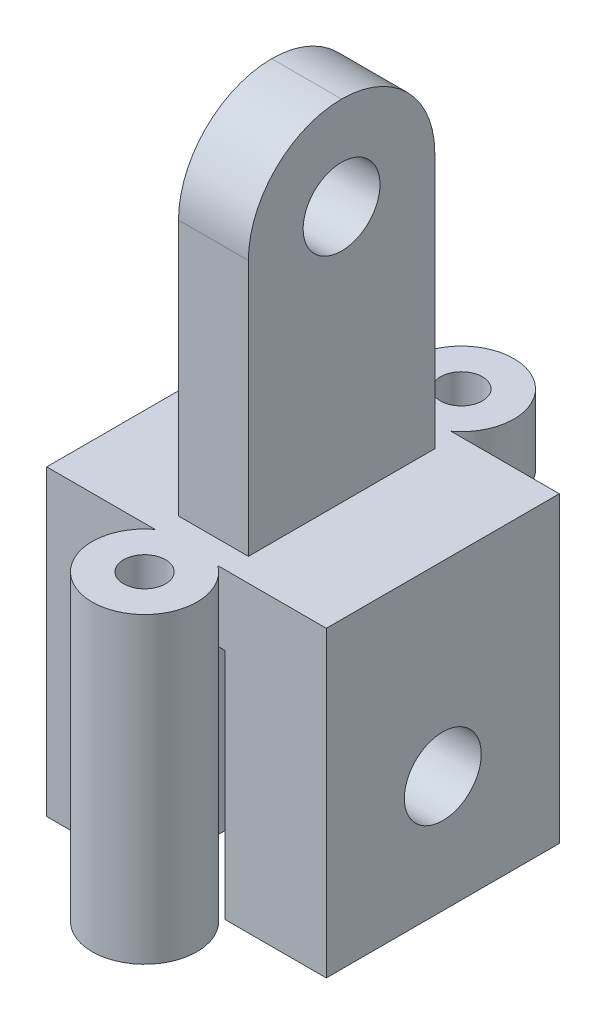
ISO-10303-21;
HEADER;
FILE_DESCRIPTION(('STEP AP214'),'2;1');
FILE_NAME('part.step','',(''),(''),'','','');
FILE_SCHEMA(('AUTOMOTIVE_DESIGN { 1 0 10303 214 1 1 1 1 }'));
ENDSEC;
DATA;
#1=APPLICATION_CONTEXT('core data for automotive mechanical design processes');
#2=APPLICATION_PROTOCOL_DEFINITION('international standard','automotive_design',2000,#1);
#3=PRODUCT_CONTEXT('',#1,'mechanical');
#4=PRODUCT('Part','Part','',(#3));
#5=PRODUCT_RELATED_PRODUCT_CATEGORY('part','',(#4));
#6=PRODUCT_DEFINITION_FORMATION('','',#4);
#7=PRODUCT_DEFINITION_CONTEXT('part definition',#1,'design');
#8=PRODUCT_DEFINITION('design','',#6,#7);
#9=PRODUCT_DEFINITION_SHAPE('','',#8);
#10=(LENGTH_UNIT() NAMED_UNIT(*) SI_UNIT(.MILLI.,.METRE.));
#11=(NAMED_UNIT(*) PLANE_ANGLE_UNIT() SI_UNIT($,.RADIAN.));
#12=(NAMED_UNIT(*) SI_UNIT($,.STERADIAN.) SOLID_ANGLE_UNIT());
#13=UNCERTAINTY_MEASURE_WITH_UNIT(LENGTH_MEASURE(1.E-05),#10,'distance_accuracy_value','');
#14=(GEOMETRIC_REPRESENTATION_CONTEXT(3) GLOBAL_UNCERTAINTY_ASSIGNED_CONTEXT((#13)) GLOBAL_UNIT_ASSIGNED_CONTEXT((#10,
#11,#12)) REPRESENTATION_CONTEXT('',''));
#15=CARTESIAN_POINT('',(0.,0.,0.));
#16=DIRECTION('',(0.,0.,1.));
#17=DIRECTION('',(1.,0.,0.));
#18=AXIS2_PLACEMENT_3D('',#15,#16,#17);
#19=CARTESIAN_POINT('',(0.,0.,10.));
#20=DIRECTION('',(0.,0.,-1.));
#21=DIRECTION('',(-1.,0.,0.));
#22=AXIS2_PLACEMENT_3D('',#19,#20,#21);
#23=PLANE('',#22);
#24=DIRECTION('',(1.,0.,0.));
#25=VECTOR('',#24,1.);
#26=CARTESIAN_POINT('',(4.35,10.,10.));
#27=LINE('',#26,#25);
#28=CARTESIAN_POINT('',(4.35,10.,10.));
#29=VERTEX_POINT('',#28);
#30=CARTESIAN_POINT('',(4.65,10.,10.));
#31=VERTEX_POINT('',#30);
#32=EDGE_CURVE('E274',#29,#31,#27,.T.);
#33=ORIENTED_EDGE('',*,*,#32,.T.);
#34=DIRECTION('',(0.,1.,0.));
#35=VECTOR('',#34,1.);
#36=CARTESIAN_POINT('',(4.65,0.,10.));
#37=LINE('',#36,#35);
#38=CARTESIAN_POINT('',(4.65,13.,10.));
#39=VERTEX_POINT('',#38);
#40=EDGE_CURVE('E11',#31,#39,#37,.T.);
#41=ORIENTED_EDGE('',*,*,#40,.T.);
#42=DIRECTION('',(-1.,0.,0.));
#43=VECTOR('',#42,1.);
#44=CARTESIAN_POINT('',(12.,13.,10.));
#45=LINE('',#44,#43);
#46=CARTESIAN_POINT('',(0.,13.,10.));
#47=VERTEX_POINT('',#46);
#48=EDGE_CURVE('E286',#39,#47,#45,.T.);
#49=ORIENTED_EDGE('',*,*,#48,.T.);
#50=DIRECTION('',(0.,-1.,0.));
#51=VECTOR('',#50,1.);
#52=CARTESIAN_POINT('',(0.,0.,10.));
#53=LINE('',#52,#51);
#54=CARTESIAN_POINT('',(0.,0.,10.));
#55=VERTEX_POINT('',#54);
#56=EDGE_CURVE('E262',#47,#55,#53,.T.);
#57=ORIENTED_EDGE('',*,*,#56,.T.);
#58=DIRECTION('',(1.,0.,0.));
#59=VECTOR('',#58,1.);
#60=CARTESIAN_POINT('',(0.,0.,10.));
#61=LINE('',#60,#59);
#62=CARTESIAN_POINT('',(4.35,0.,10.));
#63=VERTEX_POINT('',#62);
#64=EDGE_CURVE('E266',#55,#63,#61,.T.);
#65=ORIENTED_EDGE('',*,*,#64,.T.);
#66=DIRECTION('',(0.,1.,0.));
#67=VECTOR('',#66,1.);
#68=CARTESIAN_POINT('',(4.35,0.,10.));
#69=LINE('',#68,#67);
#70=EDGE_CURVE('E270',#63,#29,#69,.T.);
#71=ORIENTED_EDGE('',*,*,#70,.T.);
#72=EDGE_LOOP('',(#33,#41,#49,#57,#65,#71));
#73=FACE_BOUND('',#72,.T.);
#74=ADVANCED_FACE('F45',(#73),#23,.F.);
#75=CARTESIAN_POINT('',(0.,0.,0.));
#76=DIRECTION('',(0.,0.,-1.));
#77=DIRECTION('',(-1.,0.,0.));
#78=AXIS2_PLACEMENT_3D('',#75,#76,#77);
#79=PLANE('',#78);
#80=DIRECTION('',(0.,1.,0.));
#81=VECTOR('',#80,1.);
#82=CARTESIAN_POINT('',(4.65,10.,0.));
#83=LINE('',#82,#81);
#84=CARTESIAN_POINT('',(4.65,10.,0.));
#85=VERTEX_POINT('',#84);
#86=CARTESIAN_POINT('',(4.65,13.,0.));
#87=VERTEX_POINT('',#86);
#88=EDGE_CURVE('E206',#85,#87,#83,.T.);
#89=ORIENTED_EDGE('',*,*,#88,.F.);
#90=DIRECTION('',(1.,0.,0.));
#91=VECTOR('',#90,1.);
#92=CARTESIAN_POINT('',(4.35,10.,0.));
#93=LINE('',#92,#91);
#94=CARTESIAN_POINT('',(4.35,10.,0.));
#95=VERTEX_POINT('',#94);
#96=EDGE_CURVE('E301',#95,#85,#93,.T.);
#97=ORIENTED_EDGE('',*,*,#96,.F.);
#98=DIRECTION('',(0.,1.,0.));
#99=VECTOR('',#98,1.);
#100=CARTESIAN_POINT('',(4.35,0.,0.));
#101=LINE('',#100,#99);
#102=CARTESIAN_POINT('',(4.35,0.,0.));
#103=VERTEX_POINT('',#102);
#104=EDGE_CURVE('E297',#103,#95,#101,.T.);
#105=ORIENTED_EDGE('',*,*,#104,.F.);
#106=DIRECTION('',(1.,0.,0.));
#107=VECTOR('',#106,1.);
#108=CARTESIAN_POINT('',(0.,0.,0.));
#109=LINE('',#108,#107);
#110=CARTESIAN_POINT('',(0.,0.,0.));
#111=VERTEX_POINT('',#110);
#112=EDGE_CURVE('E294',#111,#103,#109,.T.);
#113=ORIENTED_EDGE('',*,*,#112,.F.);
#114=DIRECTION('',(0.,-1.,0.));
#115=VECTOR('',#114,1.);
#116=CARTESIAN_POINT('',(0.,0.,0.));
#117=LINE('',#116,#115);
#118=CARTESIAN_POINT('',(0.,13.,0.));
#119=VERTEX_POINT('',#118);
#120=EDGE_CURVE('E261',#119,#111,#117,.T.);
#121=ORIENTED_EDGE('',*,*,#120,.F.);
#122=DIRECTION('',(-1.,0.,0.));
#123=VECTOR('',#122,1.);
#124=CARTESIAN_POINT('',(0.,13.,0.));
#125=LINE('',#124,#123);
#126=EDGE_CURVE('E315',#87,#119,#125,.T.);
#127=ORIENTED_EDGE('',*,*,#126,.F.);
#128=EDGE_LOOP('',(#89,#97,#105,#113,#121,#127));
#129=FACE_BOUND('',#128,.T.);
#130=ADVANCED_FACE('F422',(#129),#79,.T.);
#131=CARTESIAN_POINT('',(7.65559250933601,28.,10.));
#132=DIRECTION('',(-1.,0.,0.));
#133=DIRECTION('',(0.,-1.,0.));
#134=AXIS2_PLACEMENT_3D('',#131,#132,#133);
#135=PLANE('',#134);
#136=CARTESIAN_POINT('',(7.65559250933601,24.,5.));
#137=DIRECTION('',(-1.,0.,0.));
#138=DIRECTION('',(0.,-1.,0.));
#139=AXIS2_PLACEMENT_3D('',#136,#137,#138);
#140=CIRCLE('',#139,1.65);
#141=CARTESIAN_POINT('',(7.65559250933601,22.35,5.));
#142=VERTEX_POINT('',#141);
#143=EDGE_CURVE('E237',#142,#142,#140,.T.);
#144=ORIENTED_EDGE('',*,*,#143,.T.);
#145=EDGE_LOOP('',(#144));
#146=FACE_BOUND('',#145,.T.);
#147=DIRECTION('',(0.,-1.,0.));
#148=VECTOR('',#147,1.);
#149=CARTESIAN_POINT('',(7.65559250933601,28.,1.));
#150=LINE('',#149,#148);
#151=CARTESIAN_POINT('',(7.65559250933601,24.,1.));
#152=VERTEX_POINT('',#151);
#153=CARTESIAN_POINT('',(7.65559250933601,13.,1.));
#154=VERTEX_POINT('',#153);
#155=EDGE_CURVE('E241',#152,#154,#150,.T.);
#156=ORIENTED_EDGE('',*,*,#155,.F.);
#157=CARTESIAN_POINT('',(7.65559250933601,24.,5.));
#158=DIRECTION('',(-1.,0.,0.));
#159=DIRECTION('',(0.,-1.,0.));
#160=AXIS2_PLACEMENT_3D('',#157,#158,#159);
#161=CIRCLE('',#160,4.);
#162=CARTESIAN_POINT('',(7.65559250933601,28.,5.));
#163=VERTEX_POINT('',#162);
#164=EDGE_CURVE('E365',#152,#163,#161,.F.);
#165=ORIENTED_EDGE('',*,*,#164,.T.);
#166=CARTESIAN_POINT('',(7.65559250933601,24.,5.));
#167=DIRECTION('',(-1.,0.,0.));
#168=DIRECTION('',(0.,-1.,0.));
#169=AXIS2_PLACEMENT_3D('',#166,#167,#168);
#170=CIRCLE('',#169,4.);
#171=CARTESIAN_POINT('',(7.65559250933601,24.,9.));
#172=VERTEX_POINT('',#171);
#173=EDGE_CURVE('E362',#163,#172,#170,.F.);
#174=ORIENTED_EDGE('',*,*,#173,.T.);
#175=DIRECTION('',(0.,1.,0.));
#176=VECTOR('',#175,1.);
#177=CARTESIAN_POINT('',(7.65559250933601,28.,9.));
#178=LINE('',#177,#176);
#179=CARTESIAN_POINT('',(7.65559250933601,13.,9.));
#180=VERTEX_POINT('',#179);
#181=EDGE_CURVE('E257',#180,#172,#178,.T.);
#182=ORIENTED_EDGE('',*,*,#181,.F.);
#183=DIRECTION('',(0.,0.,-1.));
#184=VECTOR('',#183,1.);
#185=CARTESIAN_POINT('',(7.65559250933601,13.,10.));
#186=LINE('',#185,#184);
#187=EDGE_CURVE('E326',#180,#154,#186,.T.);
#188=ORIENTED_EDGE('',*,*,#187,.T.);
#189=EDGE_LOOP('',(#156,#165,#174,#182,#188));
#190=FACE_BOUND('',#189,.T.);
#191=ADVANCED_FACE('F453',(#146,#190),#135,.F.);
#192=CARTESIAN_POINT('',(4.65559250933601,28.,10.));
#193=DIRECTION('',(1.,0.,0.));
#194=DIRECTION('',(0.,1.,0.));
#195=AXIS2_PLACEMENT_3D('',#192,#193,#194);
#196=PLANE('',#195);
#197=CARTESIAN_POINT('',(4.65559250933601,24.,5.));
#198=DIRECTION('',(-1.,0.,0.));
#199=DIRECTION('',(0.,-1.,0.));
#200=AXIS2_PLACEMENT_3D('',#197,#198,#199);
#201=CIRCLE('',#200,1.65);
#202=CARTESIAN_POINT('',(4.65559250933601,22.35,5.));
#203=VERTEX_POINT('',#202);
#204=EDGE_CURVE('E233',#203,#203,#201,.T.);
#205=ORIENTED_EDGE('',*,*,#204,.F.);
#206=EDGE_LOOP('',(#205));
#207=FACE_BOUND('',#206,.T.);
#208=CARTESIAN_POINT('',(4.65559250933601,24.,5.));
#209=DIRECTION('',(1.,0.,0.));
#210=DIRECTION('',(0.,1.,0.));
#211=AXIS2_PLACEMENT_3D('',#208,#209,#210);
#212=CIRCLE('',#211,4.);
#213=CARTESIAN_POINT('',(4.65559250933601,24.,9.));
#214=VERTEX_POINT('',#213);
#215=CARTESIAN_POINT('',(4.65559250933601,28.,5.));
#216=VERTEX_POINT('',#215);
#217=EDGE_CURVE('E368',#214,#216,#212,.F.);
#218=ORIENTED_EDGE('',*,*,#217,.T.);
#219=CARTESIAN_POINT('',(4.65559250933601,24.,5.));
#220=DIRECTION('',(1.,0.,0.));
#221=DIRECTION('',(0.,1.,0.));
#222=AXIS2_PLACEMENT_3D('',#219,#220,#221);
#223=CIRCLE('',#222,4.);
#224=CARTESIAN_POINT('',(4.65559250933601,24.,1.));
#225=VERTEX_POINT('',#224);
#226=EDGE_CURVE('E371',#216,#225,#223,.F.);
#227=ORIENTED_EDGE('',*,*,#226,.T.);
#228=DIRECTION('',(0.,1.,0.));
#229=VECTOR('',#228,1.);
#230=CARTESIAN_POINT('',(4.65559250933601,28.,1.));
#231=LINE('',#230,#229);
#232=CARTESIAN_POINT('',(4.65559250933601,13.,1.));
#233=VERTEX_POINT('',#232);
#234=EDGE_CURVE('E247',#233,#225,#231,.T.);
#235=ORIENTED_EDGE('',*,*,#234,.F.);
#236=DIRECTION('',(0.,0.,-1.));
#237=VECTOR('',#236,1.);
#238=CARTESIAN_POINT('',(4.65559250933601,13.,10.));
#239=LINE('',#238,#237);
#240=CARTESIAN_POINT('',(4.65559250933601,13.,9.));
#241=VERTEX_POINT('',#240);
#242=EDGE_CURVE('E322',#241,#233,#239,.T.);
#243=ORIENTED_EDGE('',*,*,#242,.F.);
#244=DIRECTION('',(0.,-1.,0.));
#245=VECTOR('',#244,1.);
#246=CARTESIAN_POINT('',(4.65559250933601,28.,9.));
#247=LINE('',#246,#245);
#248=EDGE_CURVE('E251',#214,#241,#247,.T.);
#249=ORIENTED_EDGE('',*,*,#248,.F.);
#250=EDGE_LOOP('',(#218,#227,#235,#243,#249));
#251=FACE_BOUND('',#250,.T.);
#252=ADVANCED_FACE('F473',(#207,#251),#196,.F.);
#253=CARTESIAN_POINT('',(0.,0.,10.));
#254=DIRECTION('',(1.,0.,0.));
#255=DIRECTION('',(0.,1.,0.));
#256=AXIS2_PLACEMENT_3D('',#253,#254,#255);
#257=PLANE('',#256);
#258=CARTESIAN_POINT('',(0.,5.,5.));
#259=DIRECTION('',(-1.,0.,0.));
#260=DIRECTION('',(0.,-1.,0.));
#261=AXIS2_PLACEMENT_3D('',#258,#259,#260);
#262=CIRCLE('',#261,1.65);
#263=CARTESIAN_POINT('',(0.,3.35,5.));
#264=VERTEX_POINT('',#263);
#265=EDGE_CURVE('E213',#264,#264,#262,.T.);
#266=ORIENTED_EDGE('',*,*,#265,.F.);
#267=EDGE_LOOP('',(#266));
#268=FACE_BOUND('',#267,.T.);
#269=ORIENTED_EDGE('',*,*,#120,.T.);
#270=DIRECTION('',(0.,0.,-1.));
#271=VECTOR('',#270,1.);
#272=CARTESIAN_POINT('',(0.,0.,10.));
#273=LINE('',#272,#271);
#274=EDGE_CURVE('E354',#55,#111,#273,.T.);
#275=ORIENTED_EDGE('',*,*,#274,.F.);
#276=ORIENTED_EDGE('',*,*,#56,.F.);
#277=DIRECTION('',(0.,0.,-1.));
#278=VECTOR('',#277,1.);
#279=CARTESIAN_POINT('',(0.,13.,10.));
#280=LINE('',#279,#278);
#281=EDGE_CURVE('E290',#47,#119,#280,.T.);
#282=ORIENTED_EDGE('',*,*,#281,.T.);
#283=EDGE_LOOP('',(#269,#275,#276,#282));
#284=FACE_BOUND('',#283,.T.);
#285=ADVANCED_FACE('F428',(#268,#284),#257,.F.);
#286=CARTESIAN_POINT('',(0.,0.,10.));
#287=DIRECTION('',(0.,1.,0.));
#288=DIRECTION('',(0.,0.,1.));
#289=AXIS2_PLACEMENT_3D('',#286,#287,#288);
#290=PLANE('',#289);
#291=ORIENTED_EDGE('',*,*,#112,.T.);
#292=DIRECTION('',(0.,0.,-1.));
#293=VECTOR('',#292,1.);
#294=CARTESIAN_POINT('',(4.35,0.,10.));
#295=LINE('',#294,#293);
#296=EDGE_CURVE('E350',#63,#103,#295,.T.);
#297=ORIENTED_EDGE('',*,*,#296,.F.);
#298=ORIENTED_EDGE('',*,*,#64,.F.);
#299=ORIENTED_EDGE('',*,*,#274,.T.);
#300=EDGE_LOOP('',(#291,#297,#298,#299));
#301=FACE_BOUND('',#300,.T.);
#302=ADVANCED_FACE('F432',(#301),#290,.F.);
#303=CARTESIAN_POINT('',(4.35,0.,10.));
#304=DIRECTION('',(-1.,0.,0.));
#305=DIRECTION('',(0.,0.,1.));
#306=AXIS2_PLACEMENT_3D('',#303,#304,#305);
#307=PLANE('',#306);
#308=CARTESIAN_POINT('',(4.35,5.,5.));
#309=DIRECTION('',(-1.,0.,0.));
#310=DIRECTION('',(0.,0.,1.));
#311=AXIS2_PLACEMENT_3D('',#308,#309,#310);
#312=CIRCLE('',#311,1.65);
#313=CARTESIAN_POINT('',(4.35,3.35,5.));
#314=VERTEX_POINT('',#313);
#315=EDGE_CURVE('E228',#314,#314,#312,.T.);
#316=ORIENTED_EDGE('',*,*,#315,.T.);
#317=EDGE_LOOP('',(#316));
#318=FACE_BOUND('',#317,.T.);
#319=ORIENTED_EDGE('',*,*,#104,.T.);
#320=DIRECTION('',(0.,0.,-1.));
#321=VECTOR('',#320,1.);
#322=CARTESIAN_POINT('',(4.35,10.,10.));
#323=LINE('',#322,#321);
#324=EDGE_CURVE('E346',#29,#95,#323,.T.);
#325=ORIENTED_EDGE('',*,*,#324,.F.);
#326=ORIENTED_EDGE('',*,*,#70,.F.);
#327=ORIENTED_EDGE('',*,*,#296,.T.);
#328=EDGE_LOOP('',(#319,#325,#326,#327));
#329=FACE_BOUND('',#328,.T.);
#330=ADVANCED_FACE('F433',(#318,#329),#307,.F.);
#331=CARTESIAN_POINT('',(4.35,10.,10.));
#332=DIRECTION('',(0.,1.,0.));
#333=DIRECTION('',(0.,0.,1.));
#334=AXIS2_PLACEMENT_3D('',#331,#332,#333);
#335=PLANE('',#334);
#336=CARTESIAN_POINT('',(6.,10.,-1.8));
#337=DIRECTION('',(0.,1.,0.));
#338=DIRECTION('',(0.,0.,1.));
#339=AXIS2_PLACEMENT_3D('',#336,#337,#338);
#340=CIRCLE('',#339,0.9);
#341=CARTESIAN_POINT('',(6.,10.,-0.9));
#342=VERTEX_POINT('',#341);
#343=EDGE_CURVE('E199',#342,#342,#340,.T.);
#344=ORIENTED_EDGE('',*,*,#343,.T.);
#345=EDGE_LOOP('',(#344));
#346=FACE_BOUND('',#345,.T.);
#347=ORIENTED_EDGE('',*,*,#96,.T.);
#348=CARTESIAN_POINT('',(6.,10.,-1.8));
#349=DIRECTION('',(0.,1.,0.));
#350=DIRECTION('',(0.,0.,1.));
#351=AXIS2_PLACEMENT_3D('',#348,#349,#350);
#352=CIRCLE('',#351,2.25);
#353=CARTESIAN_POINT('',(7.35,10.,0.));
#354=VERTEX_POINT('',#353);
#355=EDGE_CURVE('E203',#354,#85,#352,.T.);
#356=ORIENTED_EDGE('',*,*,#355,.F.);
#357=CARTESIAN_POINT('',(7.65,10.,0.));
#358=VERTEX_POINT('',#357);
#359=EDGE_CURVE('E300',#354,#358,#93,.T.);
#360=ORIENTED_EDGE('',*,*,#359,.T.);
#361=DIRECTION('',(0.,0.,-1.));
#362=VECTOR('',#361,1.);
#363=CARTESIAN_POINT('',(7.65,10.,10.));
#364=LINE('',#363,#362);
#365=CARTESIAN_POINT('',(7.65,10.,10.));
#366=VERTEX_POINT('',#365);
#367=EDGE_CURVE('E342',#366,#358,#364,.T.);
#368=ORIENTED_EDGE('',*,*,#367,.F.);
#369=CARTESIAN_POINT('',(7.35,10.,10.));
#370=VERTEX_POINT('',#369);
#371=EDGE_CURVE('E273',#370,#366,#27,.T.);
#372=ORIENTED_EDGE('',*,*,#371,.F.);
#373=EDGE_CURVE('E68',#31,#370,#27,.T.);
#374=ORIENTED_EDGE('',*,*,#373,.F.);
#375=ORIENTED_EDGE('',*,*,#32,.F.);
#376=ORIENTED_EDGE('',*,*,#324,.T.);
#377=EDGE_LOOP('',(#347,#356,#360,#368,#372,#374,#375,#376));
#378=FACE_BOUND('',#377,.T.);
#379=ADVANCED_FACE('F389',(#346,#378),#335,.F.);
#380=CARTESIAN_POINT('',(7.65,0.,10.));
#381=DIRECTION('',(1.,0.,0.));
#382=DIRECTION('',(0.,0.,-1.));
#383=AXIS2_PLACEMENT_3D('',#380,#381,#382);
#384=PLANE('',#383);
#385=CARTESIAN_POINT('',(7.65,5.,5.));
#386=DIRECTION('',(1.,0.,0.));
#387=DIRECTION('',(0.,0.,-1.));
#388=AXIS2_PLACEMENT_3D('',#385,#386,#387);
#389=CIRCLE('',#388,1.65);
#390=CARTESIAN_POINT('',(7.65,3.35,5.));
#391=VERTEX_POINT('',#390);
#392=EDGE_CURVE('E221',#391,#391,#389,.T.);
#393=ORIENTED_EDGE('',*,*,#392,.T.);
#394=EDGE_LOOP('',(#393));
#395=FACE_BOUND('',#394,.T.);
#396=DIRECTION('',(0.,-1.,0.));
#397=VECTOR('',#396,1.);
#398=CARTESIAN_POINT('',(7.65,0.,0.));
#399=LINE('',#398,#397);
#400=CARTESIAN_POINT('',(7.65,0.,0.));
#401=VERTEX_POINT('',#400);
#402=EDGE_CURVE('E305',#358,#401,#399,.T.);
#403=ORIENTED_EDGE('',*,*,#402,.T.);
#404=DIRECTION('',(0.,0.,-1.));
#405=VECTOR('',#404,1.);
#406=CARTESIAN_POINT('',(7.65,0.,10.));
#407=LINE('',#406,#405);
#408=CARTESIAN_POINT('',(7.65,0.,10.));
#409=VERTEX_POINT('',#408);
#410=EDGE_CURVE('E338',#409,#401,#407,.T.);
#411=ORIENTED_EDGE('',*,*,#410,.F.);
#412=DIRECTION('',(0.,-1.,0.));
#413=VECTOR('',#412,1.);
#414=CARTESIAN_POINT('',(7.65,0.,10.));
#415=LINE('',#414,#413);
#416=EDGE_CURVE('E277',#366,#409,#415,.T.);
#417=ORIENTED_EDGE('',*,*,#416,.F.);
#418=ORIENTED_EDGE('',*,*,#367,.T.);
#419=EDGE_LOOP('',(#403,#411,#417,#418));
#420=FACE_BOUND('',#419,.T.);
#421=ADVANCED_FACE('F394',(#395,#420),#384,.F.);
#422=CARTESIAN_POINT('',(7.65,0.,10.));
#423=DIRECTION('',(0.,1.,0.));
#424=DIRECTION('',(0.,0.,1.));
#425=AXIS2_PLACEMENT_3D('',#422,#423,#424);
#426=PLANE('',#425);
#427=DIRECTION('',(1.,0.,0.));
#428=VECTOR('',#427,1.);
#429=CARTESIAN_POINT('',(7.65,0.,0.));
#430=LINE('',#429,#428);
#431=CARTESIAN_POINT('',(12.,0.,0.));
#432=VERTEX_POINT('',#431);
#433=EDGE_CURVE('E308',#401,#432,#430,.T.);
#434=ORIENTED_EDGE('',*,*,#433,.T.);
#435=DIRECTION('',(0.,0.,-1.));
#436=VECTOR('',#435,1.);
#437=CARTESIAN_POINT('',(12.,0.,10.));
#438=LINE('',#437,#436);
#439=CARTESIAN_POINT('',(12.,0.,10.));
#440=VERTEX_POINT('',#439);
#441=EDGE_CURVE('E334',#440,#432,#438,.T.);
#442=ORIENTED_EDGE('',*,*,#441,.F.);
#443=DIRECTION('',(1.,0.,0.));
#444=VECTOR('',#443,1.);
#445=CARTESIAN_POINT('',(7.65,0.,10.));
#446=LINE('',#445,#444);
#447=EDGE_CURVE('E280',#409,#440,#446,.T.);
#448=ORIENTED_EDGE('',*,*,#447,.F.);
#449=ORIENTED_EDGE('',*,*,#410,.T.);
#450=EDGE_LOOP('',(#434,#442,#448,#449));
#451=FACE_BOUND('',#450,.T.);
#452=ADVANCED_FACE('F401',(#451),#426,.F.);
#453=CARTESIAN_POINT('',(12.,0.,10.));
#454=DIRECTION('',(-1.,0.,0.));
#455=DIRECTION('',(0.,-1.,0.));
#456=AXIS2_PLACEMENT_3D('',#453,#454,#455);
#457=PLANE('',#456);
#458=CARTESIAN_POINT('',(12.,5.,5.));
#459=DIRECTION('',(-1.,0.,0.));
#460=DIRECTION('',(0.,-1.,0.));
#461=AXIS2_PLACEMENT_3D('',#458,#459,#460);
#462=CIRCLE('',#461,1.65);
#463=CARTESIAN_POINT('',(12.,3.35,5.));
#464=VERTEX_POINT('',#463);
#465=EDGE_CURVE('E217',#464,#464,#462,.T.);
#466=ORIENTED_EDGE('',*,*,#465,.T.);
#467=EDGE_LOOP('',(#466));
#468=FACE_BOUND('',#467,.T.);
#469=DIRECTION('',(0.,1.,0.));
#470=VECTOR('',#469,1.);
#471=CARTESIAN_POINT('',(12.,0.,0.));
#472=LINE('',#471,#470);
#473=CARTESIAN_POINT('',(12.,13.,0.));
#474=VERTEX_POINT('',#473);
#475=EDGE_CURVE('E311',#432,#474,#472,.T.);
#476=ORIENTED_EDGE('',*,*,#475,.T.);
#477=DIRECTION('',(0.,0.,-1.));
#478=VECTOR('',#477,1.);
#479=CARTESIAN_POINT('',(12.,13.,10.));
#480=LINE('',#479,#478);
#481=CARTESIAN_POINT('',(12.,13.,10.));
#482=VERTEX_POINT('',#481);
#483=EDGE_CURVE('E330',#482,#474,#480,.T.);
#484=ORIENTED_EDGE('',*,*,#483,.F.);
#485=DIRECTION('',(0.,1.,0.));
#486=VECTOR('',#485,1.);
#487=CARTESIAN_POINT('',(12.,0.,10.));
#488=LINE('',#487,#486);
#489=EDGE_CURVE('E283',#440,#482,#488,.T.);
#490=ORIENTED_EDGE('',*,*,#489,.F.);
#491=ORIENTED_EDGE('',*,*,#441,.T.);
#492=EDGE_LOOP('',(#476,#484,#490,#491));
#493=FACE_BOUND('',#492,.T.);
#494=ADVANCED_FACE('F405',(#468,#493),#457,.F.);
#495=CARTESIAN_POINT('',(0.,13.,10.));
#496=DIRECTION('',(0.,-1.,0.));
#497=DIRECTION('',(0.,0.,-1.));
#498=AXIS2_PLACEMENT_3D('',#495,#496,#497);
#499=PLANE('',#498);
#500=CARTESIAN_POINT('',(6.,13.,11.8));
#501=DIRECTION('',(0.,-1.,0.));
#502=DIRECTION('',(0.,0.,-1.));
#503=AXIS2_PLACEMENT_3D('',#500,#501,#502);
#504=CIRCLE('',#503,0.899999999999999);
#505=CARTESIAN_POINT('',(6.,13.,12.7));
#506=VERTEX_POINT('',#505);
#507=EDGE_CURVE('E675',#506,#506,#504,.T.);
#508=ORIENTED_EDGE('',*,*,#507,.T.);
#509=EDGE_LOOP('',(#508));
#510=FACE_BOUND('',#509,.T.);
#511=CARTESIAN_POINT('',(6.,13.,-1.8));
#512=DIRECTION('',(0.,-1.,0.));
#513=DIRECTION('',(0.,0.,-1.));
#514=AXIS2_PLACEMENT_3D('',#511,#512,#513);
#515=CIRCLE('',#514,0.9);
#516=CARTESIAN_POINT('',(6.,13.,-0.9));
#517=VERTEX_POINT('',#516);
#518=EDGE_CURVE('E49',#517,#517,#515,.T.);
#519=ORIENTED_EDGE('',*,*,#518,.T.);
#520=EDGE_LOOP('',(#519));
#521=FACE_BOUND('',#520,.T.);
#522=ORIENTED_EDGE('',*,*,#483,.T.);
#523=CARTESIAN_POINT('',(7.35,13.,0.));
#524=VERTEX_POINT('',#523);
#525=EDGE_CURVE('E267',#474,#524,#125,.T.);
#526=ORIENTED_EDGE('',*,*,#525,.T.);
#527=CARTESIAN_POINT('',(6.,13.,-1.8));
#528=DIRECTION('',(0.,1.,0.));
#529=DIRECTION('',(0.,0.,1.));
#530=AXIS2_PLACEMENT_3D('',#527,#528,#529);
#531=CIRCLE('',#530,2.25);
#532=EDGE_CURVE('E201',#524,#87,#531,.T.);
#533=ORIENTED_EDGE('',*,*,#532,.T.);
#534=ORIENTED_EDGE('',*,*,#126,.T.);
#535=ORIENTED_EDGE('',*,*,#281,.F.);
#536=ORIENTED_EDGE('',*,*,#48,.F.);
#537=CARTESIAN_POINT('',(6.,13.,11.8));
#538=DIRECTION('',(0.,1.,0.));
#539=DIRECTION('',(0.,0.,1.));
#540=AXIS2_PLACEMENT_3D('',#537,#538,#539);
#541=CIRCLE('',#540,2.25);
#542=CARTESIAN_POINT('',(7.35,13.,10.));
#543=VERTEX_POINT('',#542);
#544=EDGE_CURVE('E189',#39,#543,#541,.T.);
#545=ORIENTED_EDGE('',*,*,#544,.T.);
#546=EDGE_CURVE('E287',#482,#543,#45,.T.);
#547=ORIENTED_EDGE('',*,*,#546,.F.);
#548=EDGE_LOOP('',(#522,#526,#533,#534,#535,#536,#545,#547));
#549=FACE_BOUND('',#548,.T.);
#550=DIRECTION('',(-1.,0.,0.));
#551=VECTOR('',#550,1.);
#552=CARTESIAN_POINT('',(7.65559250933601,13.,1.));
#553=LINE('',#552,#551);
#554=EDGE_CURVE('E244',#154,#233,#553,.T.);
#555=ORIENTED_EDGE('',*,*,#554,.F.);
#556=ORIENTED_EDGE('',*,*,#187,.F.);
#557=DIRECTION('',(1.,0.,0.));
#558=VECTOR('',#557,1.);
#559=CARTESIAN_POINT('',(4.65559250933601,13.,9.));
#560=LINE('',#559,#558);
#561=EDGE_CURVE('E254',#241,#180,#560,.T.);
#562=ORIENTED_EDGE('',*,*,#561,.F.);
#563=ORIENTED_EDGE('',*,*,#242,.T.);
#564=EDGE_LOOP('',(#555,#556,#562,#563));
#565=FACE_BOUND('',#564,.T.);
#566=ADVANCED_FACE('F410',(#510,#521,#549,#565),#499,.F.);
#567=ORIENTED_EDGE('',*,*,#546,.T.);
#568=DIRECTION('',(0.,1.,0.));
#569=VECTOR('',#568,1.);
#570=CARTESIAN_POINT('',(7.35,0.,10.));
#571=LINE('',#570,#569);
#572=EDGE_CURVE('E55',#543,#370,#571,.F.);
#573=ORIENTED_EDGE('',*,*,#572,.T.);
#574=ORIENTED_EDGE('',*,*,#371,.T.);
#575=ORIENTED_EDGE('',*,*,#416,.T.);
#576=ORIENTED_EDGE('',*,*,#447,.T.);
#577=ORIENTED_EDGE('',*,*,#489,.T.);
#578=EDGE_LOOP('',(#567,#573,#574,#575,#576,#577));
#579=FACE_BOUND('',#578,.T.);
#580=ADVANCED_FACE('F408',(#579),#23,.F.);
#581=DIRECTION('',(0.,1.,0.));
#582=VECTOR('',#581,1.);
#583=CARTESIAN_POINT('',(7.35,10.,0.));
#584=LINE('',#583,#582);
#585=EDGE_CURVE('E209',#354,#524,#584,.T.);
#586=ORIENTED_EDGE('',*,*,#585,.T.);
#587=ORIENTED_EDGE('',*,*,#525,.F.);
#588=ORIENTED_EDGE('',*,*,#475,.F.);
#589=ORIENTED_EDGE('',*,*,#433,.F.);
#590=ORIENTED_EDGE('',*,*,#402,.F.);
#591=ORIENTED_EDGE('',*,*,#359,.F.);
#592=EDGE_LOOP('',(#586,#587,#588,#589,#590,#591));
#593=FACE_BOUND('',#592,.T.);
#594=ADVANCED_FACE('F397',(#593),#79,.T.);
#595=CARTESIAN_POINT('',(0.,0.,9.));
#596=DIRECTION('',(0.,0.,1.));
#597=DIRECTION('',(1.,0.,0.));
#598=AXIS2_PLACEMENT_3D('',#595,#596,#597);
#599=PLANE('',#598);
#600=ORIENTED_EDGE('',*,*,#181,.T.);
#601=DIRECTION('',(-1.,0.,0.));
#602=VECTOR('',#601,1.);
#603=CARTESIAN_POINT('',(4.65559250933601,24.,9.));
#604=LINE('',#603,#602);
#605=EDGE_CURVE('E374',#172,#214,#604,.T.);
#606=ORIENTED_EDGE('',*,*,#605,.T.);
#607=ORIENTED_EDGE('',*,*,#248,.T.);
#608=ORIENTED_EDGE('',*,*,#561,.T.);
#609=EDGE_LOOP('',(#600,#606,#607,#608));
#610=FACE_BOUND('',#609,.T.);
#611=ADVANCED_FACE('F460',(#610),#599,.T.);
#612=CARTESIAN_POINT('',(0.,0.,1.));
#613=DIRECTION('',(0.,0.,-1.));
#614=DIRECTION('',(-1.,0.,0.));
#615=AXIS2_PLACEMENT_3D('',#612,#613,#614);
#616=PLANE('',#615);
#617=ORIENTED_EDGE('',*,*,#234,.T.);
#618=DIRECTION('',(1.,0.,0.));
#619=VECTOR('',#618,1.);
#620=CARTESIAN_POINT('',(7.65559250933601,24.,1.));
#621=LINE('',#620,#619);
#622=EDGE_CURVE('E358',#225,#152,#621,.T.);
#623=ORIENTED_EDGE('',*,*,#622,.T.);
#624=ORIENTED_EDGE('',*,*,#155,.T.);
#625=ORIENTED_EDGE('',*,*,#554,.T.);
#626=EDGE_LOOP('',(#617,#623,#624,#625));
#627=FACE_BOUND('',#626,.T.);
#628=ADVANCED_FACE('F506',(#627),#616,.T.);
#629=CARTESIAN_POINT('',(12.,24.,5.));
#630=DIRECTION('',(-1.,0.,0.));
#631=DIRECTION('',(0.,-1.,0.));
#632=AXIS2_PLACEMENT_3D('',#629,#630,#631);
#633=CYLINDRICAL_SURFACE('',#632,1.65);
#634=ORIENTED_EDGE('',*,*,#204,.T.);
#635=EDGE_LOOP('',(#634));
#636=FACE_BOUND('',#635,.T.);
#637=ORIENTED_EDGE('',*,*,#143,.F.);
#638=EDGE_LOOP('',(#637));
#639=FACE_BOUND('',#638,.T.);
#640=ADVANCED_FACE('F503',(#636,#639),#633,.F.);
#641=CARTESIAN_POINT('',(0.,24.,5.));
#642=DIRECTION('',(1.,0.,0.));
#643=DIRECTION('',(0.,0.,-1.));
#644=AXIS2_PLACEMENT_3D('',#641,#642,#643);
#645=CYLINDRICAL_SURFACE('',#644,4.);
#646=DIRECTION('',(-1.,0.,0.));
#647=VECTOR('',#646,1.);
#648=CARTESIAN_POINT('',(7.65559250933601,28.,5.));
#649=LINE('',#648,#647);
#650=EDGE_CURVE('E232',#216,#163,#649,.F.);
#651=ORIENTED_EDGE('',*,*,#650,.F.);
#652=ORIENTED_EDGE('',*,*,#217,.F.);
#653=ORIENTED_EDGE('',*,*,#605,.F.);
#654=ORIENTED_EDGE('',*,*,#173,.F.);
#655=EDGE_LOOP('',(#651,#652,#653,#654));
#656=FACE_BOUND('',#655,.T.);
#657=ADVANCED_FACE('F47',(#656),#645,.T.);
#658=CARTESIAN_POINT('',(0.,24.,5.));
#659=DIRECTION('',(-1.,0.,0.));
#660=DIRECTION('',(0.,0.,1.));
#661=AXIS2_PLACEMENT_3D('',#658,#659,#660);
#662=CYLINDRICAL_SURFACE('',#661,4.);
#663=ORIENTED_EDGE('',*,*,#226,.F.);
#664=ORIENTED_EDGE('',*,*,#650,.T.);
#665=ORIENTED_EDGE('',*,*,#164,.F.);
#666=ORIENTED_EDGE('',*,*,#622,.F.);
#667=EDGE_LOOP('',(#663,#664,#665,#666));
#668=FACE_BOUND('',#667,.T.);
#669=ADVANCED_FACE('F490',(#668),#662,.T.);
#670=CARTESIAN_POINT('',(12.,5.,5.));
#671=DIRECTION('',(-1.,0.,0.));
#672=DIRECTION('',(0.,-1.,0.));
#673=AXIS2_PLACEMENT_3D('',#670,#671,#672);
#674=CYLINDRICAL_SURFACE('',#673,1.65);
#675=CARTESIAN_POINT('',(12.,3.35,5.));
#676=CARTESIAN_POINT('',(11.9546875,3.35,5.));
#677=CARTESIAN_POINT('',(11.909375,3.35,5.));
#678=CARTESIAN_POINT('',(11.81875,3.35,5.));
#679=CARTESIAN_POINT('',(11.7734375,3.35,5.));
#680=CARTESIAN_POINT('',(11.6828125,3.35,5.));
#681=CARTESIAN_POINT('',(11.6375,3.35,5.));
#682=CARTESIAN_POINT('',(11.546875,3.35,5.));
#683=CARTESIAN_POINT('',(11.5015625,3.35,5.));
#684=CARTESIAN_POINT('',(11.4109375,3.35,5.));
#685=CARTESIAN_POINT('',(11.365625,3.35,5.));
#686=CARTESIAN_POINT('',(11.275,3.35,5.));
#687=CARTESIAN_POINT('',(11.2296875,3.35,5.));
#688=CARTESIAN_POINT('',(11.1390625,3.35,5.));
#689=CARTESIAN_POINT('',(11.09375,3.35,5.));
#690=CARTESIAN_POINT('',(11.003125,3.35,5.));
#691=CARTESIAN_POINT('',(10.9578125,3.35,5.));
#692=CARTESIAN_POINT('',(10.8671875,3.35,5.));
#693=CARTESIAN_POINT('',(10.821875,3.35,5.));
#694=CARTESIAN_POINT('',(10.73125,3.35,5.));
#695=CARTESIAN_POINT('',(10.6859375,3.35,5.));
#696=CARTESIAN_POINT('',(10.5953125,3.35,5.));
#697=CARTESIAN_POINT('',(10.55,3.35,5.));
#698=CARTESIAN_POINT('',(10.459375,3.35,5.));
#699=CARTESIAN_POINT('',(10.4140625,3.35,5.));
#700=CARTESIAN_POINT('',(10.3234375,3.35,5.));
#701=CARTESIAN_POINT('',(10.278125,3.35,5.));
#702=CARTESIAN_POINT('',(10.1875,3.35,5.));
#703=CARTESIAN_POINT('',(10.1421875,3.35,5.));
#704=CARTESIAN_POINT('',(10.0515625,3.35,5.));
#705=CARTESIAN_POINT('',(10.00625,3.35,5.));
#706=CARTESIAN_POINT('',(9.915625,3.35,5.));
#707=CARTESIAN_POINT('',(9.8703125,3.35,5.));
#708=CARTESIAN_POINT('',(9.7796875,3.35,5.));
#709=CARTESIAN_POINT('',(9.734375,3.35,5.));
#710=CARTESIAN_POINT('',(9.64375,3.35,5.));
#711=CARTESIAN_POINT('',(9.5984375,3.35,5.));
#712=CARTESIAN_POINT('',(9.5078125,3.35,5.));
#713=CARTESIAN_POINT('',(9.4625,3.35,5.));
#714=CARTESIAN_POINT('',(9.371875,3.35,5.));
#715=CARTESIAN_POINT('',(9.3265625,3.35,5.));
#716=CARTESIAN_POINT('',(9.2359375,3.35,5.));
#717=CARTESIAN_POINT('',(9.190625,3.35,5.));
#718=CARTESIAN_POINT('',(9.1,3.35,5.));
#719=CARTESIAN_POINT('',(9.0546875,3.35,5.));
#720=CARTESIAN_POINT('',(8.9640625,3.35,5.));
#721=CARTESIAN_POINT('',(8.91875,3.35,5.));
#722=CARTESIAN_POINT('',(8.828125,3.35,5.));
#723=CARTESIAN_POINT('',(8.7828125,3.35,5.));
#724=CARTESIAN_POINT('',(8.6921875,3.35,5.));
#725=CARTESIAN_POINT('',(8.646875,3.35,5.));
#726=CARTESIAN_POINT('',(8.55625,3.35,5.));
#727=CARTESIAN_POINT('',(8.5109375,3.35,5.));
#728=CARTESIAN_POINT('',(8.4203125,3.35,5.));
#729=CARTESIAN_POINT('',(8.375,3.35,5.));
#730=CARTESIAN_POINT('',(8.284375,3.35,5.));
#731=CARTESIAN_POINT('',(8.2390625,3.35,5.));
#732=CARTESIAN_POINT('',(8.1484375,3.35,5.));
#733=CARTESIAN_POINT('',(8.103125,3.35,5.));
#734=CARTESIAN_POINT('',(8.0125,3.35,5.));
#735=CARTESIAN_POINT('',(7.9671875,3.35,5.));
#736=CARTESIAN_POINT('',(7.8765625,3.35,5.));
#737=CARTESIAN_POINT('',(7.83125,3.35,5.));
#738=CARTESIAN_POINT('',(7.740625,3.35,5.));
#739=CARTESIAN_POINT('',(7.6953125,3.35,5.));
#740=CARTESIAN_POINT('',(7.65,3.35,5.));
#741=B_SPLINE_CURVE_WITH_KNOTS('',3,(#675,#676,#677,#678,#679,#680,#681,#682,#683,#684,#685,
#686,#687,#688,#689,#690,#691,#692,#693,#694,#695,#696,#697,#698,#699,#700,#701,#702,#703,#704,
#705,#706,#707,#708,#709,#710,#711,#712,#713,#714,#715,#716,#717,#718,#719,#720,#721,#722,#723,
#724,#725,#726,#727,#728,#729,#730,#731,#732,#733,#734,#735,#736,#737,#738,#739,#740),
.UNSPECIFIED.,.F.,.F.,(4,2,2,2,2,2,2,2,2,2,2,2,2,2,2,2,2,2,2,2,2,2,2,2,2,2,2,2,2,2,2,2,4),(0.,
0.135937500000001,0.271875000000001,0.4078125,0.543750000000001,0.679687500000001,0.815625,
0.951562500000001,1.0875,1.2234375,1.359375,1.4953125,1.63125,1.7671875,1.903125,2.0390625,
2.175,2.3109375,2.446875,2.5828125,2.71875,2.8546875,2.990625,3.1265625,3.2625,3.3984375,
3.534375,3.6703125,3.80625,3.9421875,4.078125,4.2140625,4.35),.UNSPECIFIED.);
#742=EDGE_CURVE('BSEAM487',#464,#391,#741,.T.);
#743=ORIENTED_EDGE('',*,*,#465,.F.);
#744=ORIENTED_EDGE('',*,*,#392,.F.);
#745=ORIENTED_EDGE('',*,*,#742,.T.);
#746=ORIENTED_EDGE('',*,*,#742,.F.);
#747=EDGE_LOOP('',(#743,#745,#744,#746));
#748=FACE_BOUND('',#747,.T.);
#749=ADVANCED_FACE('F487',(#748),#674,.F.);
#750=CARTESIAN_POINT('',(0.,3.35,5.));
#751=CARTESIAN_POINT('',(0.0453125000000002,3.35,5.));
#752=CARTESIAN_POINT('',(0.0906250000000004,3.35,5.));
#753=CARTESIAN_POINT('',(0.18125,3.35,5.));
#754=CARTESIAN_POINT('',(0.2265625,3.35,5.));
#755=CARTESIAN_POINT('',(0.3171875,3.35,5.));
#756=CARTESIAN_POINT('',(0.3625,3.35,5.));
#757=CARTESIAN_POINT('',(0.453125,3.35,5.));
#758=CARTESIAN_POINT('',(0.498437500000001,3.35,5.));
#759=CARTESIAN_POINT('',(0.5890625,3.35,5.));
#760=CARTESIAN_POINT('',(0.634375,3.35,5.));
#761=CARTESIAN_POINT('',(0.725,3.35,5.));
#762=CARTESIAN_POINT('',(0.7703125,3.35,5.));
#763=CARTESIAN_POINT('',(0.860937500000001,3.35,5.));
#764=CARTESIAN_POINT('',(0.906250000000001,3.35,5.));
#765=CARTESIAN_POINT('',(0.996875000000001,3.35,5.));
#766=CARTESIAN_POINT('',(1.0421875,3.35,5.));
#767=CARTESIAN_POINT('',(1.1328125,3.35,5.));
#768=CARTESIAN_POINT('',(1.178125,3.35,5.));
#769=CARTESIAN_POINT('',(1.26875,3.35,5.));
#770=CARTESIAN_POINT('',(1.3140625,3.35,5.));
#771=CARTESIAN_POINT('',(1.4046875,3.35,5.));
#772=CARTESIAN_POINT('',(1.45,3.35,5.));
#773=CARTESIAN_POINT('',(1.540625,3.35,5.));
#774=CARTESIAN_POINT('',(1.5859375,3.35,5.));
#775=CARTESIAN_POINT('',(1.6765625,3.35,5.));
#776=CARTESIAN_POINT('',(1.721875,3.35,5.));
#777=CARTESIAN_POINT('',(1.8125,3.35,5.));
#778=CARTESIAN_POINT('',(1.8578125,3.35,5.));
#779=CARTESIAN_POINT('',(1.9484375,3.35,5.));
#780=CARTESIAN_POINT('',(1.99375,3.35,5.));
#781=CARTESIAN_POINT('',(2.084375,3.35,5.));
#782=CARTESIAN_POINT('',(2.1296875,3.35,5.));
#783=CARTESIAN_POINT('',(2.2203125,3.35,5.));
#784=CARTESIAN_POINT('',(2.265625,3.35,5.));
#785=CARTESIAN_POINT('',(2.35625,3.35,5.));
#786=CARTESIAN_POINT('',(2.4015625,3.35,5.));
#787=CARTESIAN_POINT('',(2.4921875,3.35,5.));
#788=CARTESIAN_POINT('',(2.5375,3.35,5.));
#789=CARTESIAN_POINT('',(2.628125,3.35,5.));
#790=CARTESIAN_POINT('',(2.6734375,3.35,5.));
#791=CARTESIAN_POINT('',(2.7640625,3.35,5.));
#792=CARTESIAN_POINT('',(2.809375,3.35,5.));
#793=CARTESIAN_POINT('',(2.9,3.35,5.));
#794=CARTESIAN_POINT('',(2.9453125,3.35,5.));
#795=CARTESIAN_POINT('',(3.0359375,3.35,5.));
#796=CARTESIAN_POINT('',(3.08125,3.35,5.));
#797=CARTESIAN_POINT('',(3.171875,3.35,5.));
#798=CARTESIAN_POINT('',(3.2171875,3.35,5.));
#799=CARTESIAN_POINT('',(3.3078125,3.35,5.));
#800=CARTESIAN_POINT('',(3.353125,3.35,5.));
#801=CARTESIAN_POINT('',(3.44375,3.35,5.));
#802=CARTESIAN_POINT('',(3.4890625,3.35,5.));
#803=CARTESIAN_POINT('',(3.5796875,3.35,5.));
#804=CARTESIAN_POINT('',(3.625,3.35,5.));
#805=CARTESIAN_POINT('',(3.715625,3.35,5.));
#806=CARTESIAN_POINT('',(3.7609375,3.35,5.));
#807=CARTESIAN_POINT('',(3.8515625,3.35,5.));
#808=CARTESIAN_POINT('',(3.896875,3.35,5.));
#809=CARTESIAN_POINT('',(3.9875,3.35,5.));
#810=CARTESIAN_POINT('',(4.0328125,3.35,5.));
#811=CARTESIAN_POINT('',(4.1234375,3.35,5.));
#812=CARTESIAN_POINT('',(4.16875,3.35,5.));
#813=CARTESIAN_POINT('',(4.259375,3.35,5.));
#814=CARTESIAN_POINT('',(4.3046875,3.35,5.));
#815=CARTESIAN_POINT('',(4.35,3.35,5.));
#816=B_SPLINE_CURVE_WITH_KNOTS('',3,(#750,#751,#752,#753,#754,#755,#756,#757,#758,#759,#760,
#761,#762,#763,#764,#765,#766,#767,#768,#769,#770,#771,#772,#773,#774,#775,#776,#777,#778,#779,
#780,#781,#782,#783,#784,#785,#786,#787,#788,#789,#790,#791,#792,#793,#794,#795,#796,#797,#798,
#799,#800,#801,#802,#803,#804,#805,#806,#807,#808,#809,#810,#811,#812,#813,#814,#815),
.UNSPECIFIED.,.F.,.F.,(4,2,2,2,2,2,2,2,2,2,2,2,2,2,2,2,2,2,2,2,2,2,2,2,2,2,2,2,2,2,2,2,4),(0.,
0.135937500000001,0.271875,0.4078125,0.543750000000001,0.6796875,0.815625,0.951562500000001,
1.0875,1.2234375,1.359375,1.4953125,1.63125,1.7671875,1.903125,2.0390625,2.175,2.3109375,
2.446875,2.5828125,2.71875,2.8546875,2.990625,3.1265625,3.2625,3.3984375,3.534375,3.6703125,
3.80625,3.9421875,4.078125,4.2140625,4.35),.UNSPECIFIED.);
#817=EDGE_CURVE('BSEAM489',#264,#314,#816,.T.);
#818=ORIENTED_EDGE('',*,*,#265,.T.);
#819=ORIENTED_EDGE('',*,*,#315,.F.);
#820=ORIENTED_EDGE('',*,*,#817,.T.);
#821=ORIENTED_EDGE('',*,*,#817,.F.);
#822=EDGE_LOOP('',(#818,#820,#819,#821));
#823=FACE_BOUND('',#822,.T.);
#824=ADVANCED_FACE('F489',(#823),#674,.F.);
#825=CARTESIAN_POINT('',(6.,10.,-1.8));
#826=DIRECTION('',(0.,1.,0.));
#827=DIRECTION('',(0.,0.,1.));
#828=AXIS2_PLACEMENT_3D('',#825,#826,#827);
#829=CYLINDRICAL_SURFACE('',#828,2.25);
#830=ORIENTED_EDGE('',*,*,#532,.F.);
#831=ORIENTED_EDGE('',*,*,#585,.F.);
#832=ORIENTED_EDGE('',*,*,#355,.T.);
#833=ORIENTED_EDGE('',*,*,#88,.T.);
#834=EDGE_LOOP('',(#830,#831,#832,#833));
#835=FACE_BOUND('',#834,.T.);
#836=ADVANCED_FACE('F426',(#835),#829,.T.);
#837=CARTESIAN_POINT('',(4.65,0.,10.));
#838=DIRECTION('',(0.,0.,-1.));
#839=DIRECTION('',(-1.,0.,0.));
#840=AXIS2_PLACEMENT_3D('',#837,#838,#839);
#841=PLANE('',#840);
#842=ORIENTED_EDGE('',*,*,#373,.T.);
#843=DIRECTION('',(0.,1.,0.));
#844=VECTOR('',#843,1.);
#845=CARTESIAN_POINT('',(7.35,0.,10.));
#846=LINE('',#845,#844);
#847=CARTESIAN_POINT('',(7.35,0.,10.));
#848=VERTEX_POINT('',#847);
#849=EDGE_CURVE('E172',#848,#370,#846,.T.);
#850=ORIENTED_EDGE('',*,*,#849,.F.);
#851=DIRECTION('',(-1.,0.,0.));
#852=VECTOR('',#851,1.);
#853=CARTESIAN_POINT('',(4.65,0.,10.));
#854=LINE('',#853,#852);
#855=CARTESIAN_POINT('',(4.65,0.,10.));
#856=VERTEX_POINT('',#855);
#857=EDGE_CURVE('E177',#848,#856,#854,.T.);
#858=ORIENTED_EDGE('',*,*,#857,.T.);
#859=DIRECTION('',(0.,1.,0.));
#860=VECTOR('',#859,1.);
#861=CARTESIAN_POINT('',(4.65,0.,10.));
#862=LINE('',#861,#860);
#863=EDGE_CURVE('E180',#856,#31,#862,.T.);
#864=ORIENTED_EDGE('',*,*,#863,.T.);
#865=EDGE_LOOP('',(#842,#850,#858,#864));
#866=FACE_BOUND('',#865,.T.);
#867=ADVANCED_FACE('F174',(#866),#841,.T.);
#868=CARTESIAN_POINT('',(6.,0.,11.8));
#869=DIRECTION('',(0.,1.,0.));
#870=DIRECTION('',(0.,0.,1.));
#871=AXIS2_PLACEMENT_3D('',#868,#869,#870);
#872=CYLINDRICAL_SURFACE('',#871,2.25);
#873=ORIENTED_EDGE('',*,*,#544,.F.);
#874=ORIENTED_EDGE('',*,*,#40,.F.);
#875=ORIENTED_EDGE('',*,*,#863,.F.);
#876=CARTESIAN_POINT('',(6.,0.,11.8));
#877=DIRECTION('',(0.,1.,0.));
#878=DIRECTION('',(0.,0.,1.));
#879=AXIS2_PLACEMENT_3D('',#876,#877,#878);
#880=CIRCLE('',#879,2.25);
#881=EDGE_CURVE('E183',#856,#848,#880,.T.);
#882=ORIENTED_EDGE('',*,*,#881,.T.);
#883=ORIENTED_EDGE('',*,*,#849,.T.);
#884=ORIENTED_EDGE('',*,*,#572,.F.);
#885=EDGE_LOOP('',(#873,#874,#875,#882,#883,#884));
#886=FACE_BOUND('',#885,.T.);
#887=ADVANCED_FACE('F185',(#886),#872,.T.);
#888=CARTESIAN_POINT('',(6.,0.,11.8));
#889=DIRECTION('',(0.,1.,0.));
#890=DIRECTION('',(0.,0.,1.));
#891=AXIS2_PLACEMENT_3D('',#888,#889,#890);
#892=PLANE('',#891);
#893=CARTESIAN_POINT('',(6.,0.,11.8));
#894=DIRECTION('',(0.,1.,0.));
#895=DIRECTION('',(0.,0.,1.));
#896=AXIS2_PLACEMENT_3D('',#893,#894,#895);
#897=CIRCLE('',#896,0.899999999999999);
#898=CARTESIAN_POINT('',(6.,0.,12.7));
#899=VERTEX_POINT('',#898);
#900=EDGE_CURVE('E679',#899,#899,#897,.T.);
#901=ORIENTED_EDGE('',*,*,#900,.T.);
#902=EDGE_LOOP('',(#901));
#903=FACE_BOUND('',#902,.T.);
#904=ORIENTED_EDGE('',*,*,#881,.F.);
#905=ORIENTED_EDGE('',*,*,#857,.F.);
#906=EDGE_LOOP('',(#904,#905));
#907=FACE_BOUND('',#906,.T.);
#908=ADVANCED_FACE('F191',(#903,#907),#892,.F.);
#909=CARTESIAN_POINT('',(6.,0.,11.8));
#910=DIRECTION('',(0.,1.,0.));
#911=DIRECTION('',(0.,0.,1.));
#912=AXIS2_PLACEMENT_3D('',#909,#910,#911);
#913=CYLINDRICAL_SURFACE('',#912,0.899999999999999);
#914=CARTESIAN_POINT('',(6.,0.,12.7));
#915=CARTESIAN_POINT('',(6.,0.135416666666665,12.7));
#916=CARTESIAN_POINT('',(6.,0.270833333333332,12.7));
#917=CARTESIAN_POINT('',(6.,0.541666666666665,12.7));
#918=CARTESIAN_POINT('',(6.,0.677083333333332,12.7));
#919=CARTESIAN_POINT('',(6.,0.947916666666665,12.7));
#920=CARTESIAN_POINT('',(6.,1.08333333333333,12.7));
#921=CARTESIAN_POINT('',(6.,1.35416666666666,12.7));
#922=CARTESIAN_POINT('',(6.,1.48958333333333,12.7));
#923=CARTESIAN_POINT('',(6.,1.76041666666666,12.7));
#924=CARTESIAN_POINT('',(6.,1.89583333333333,12.7));
#925=CARTESIAN_POINT('',(6.,2.16666666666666,12.7));
#926=CARTESIAN_POINT('',(6.,2.30208333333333,12.7));
#927=CARTESIAN_POINT('',(6.,2.57291666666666,12.7));
#928=CARTESIAN_POINT('',(6.,2.70833333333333,12.7));
#929=CARTESIAN_POINT('',(6.,2.97916666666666,12.7));
#930=CARTESIAN_POINT('',(6.,3.11458333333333,12.7));
#931=CARTESIAN_POINT('',(6.,3.38541666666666,12.7));
#932=CARTESIAN_POINT('',(6.,3.52083333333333,12.7));
#933=CARTESIAN_POINT('',(6.,3.79166666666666,12.7));
#934=CARTESIAN_POINT('',(6.,3.92708333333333,12.7));
#935=CARTESIAN_POINT('',(6.,4.19791666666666,12.7));
#936=CARTESIAN_POINT('',(6.,4.33333333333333,12.7));
#937=CARTESIAN_POINT('',(6.,4.60416666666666,12.7));
#938=CARTESIAN_POINT('',(6.,4.73958333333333,12.7));
#939=CARTESIAN_POINT('',(6.,5.01041666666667,12.7));
#940=CARTESIAN_POINT('',(6.,5.14583333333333,12.7));
#941=CARTESIAN_POINT('',(6.,5.41666666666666,12.7));
#942=CARTESIAN_POINT('',(6.,5.55208333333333,12.7));
#943=CARTESIAN_POINT('',(6.,5.82291666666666,12.7));
#944=CARTESIAN_POINT('',(6.,5.95833333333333,12.7));
#945=CARTESIAN_POINT('',(6.,6.22916666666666,12.7));
#946=CARTESIAN_POINT('',(6.,6.36458333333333,12.7));
#947=CARTESIAN_POINT('',(6.,6.63541666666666,12.7));
#948=CARTESIAN_POINT('',(6.,6.77083333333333,12.7));
#949=CARTESIAN_POINT('',(6.,7.04166666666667,12.7));
#950=CARTESIAN_POINT('',(6.,7.17708333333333,12.7));
#951=CARTESIAN_POINT('',(6.,7.44791666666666,12.7));
#952=CARTESIAN_POINT('',(6.,7.58333333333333,12.7));
#953=CARTESIAN_POINT('',(6.,7.85416666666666,12.7));
#954=CARTESIAN_POINT('',(6.,7.98958333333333,12.7));
#955=CARTESIAN_POINT('',(6.,8.26041666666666,12.7));
#956=CARTESIAN_POINT('',(6.,8.39583333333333,12.7));
#957=CARTESIAN_POINT('',(6.,8.66666666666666,12.7));
#958=CARTESIAN_POINT('',(6.,8.80208333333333,12.7));
#959=CARTESIAN_POINT('',(6.,9.07291666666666,12.7));
#960=CARTESIAN_POINT('',(6.,9.20833333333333,12.7));
#961=CARTESIAN_POINT('',(6.,9.47916666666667,12.7));
#962=CARTESIAN_POINT('',(6.,9.61458333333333,12.7));
#963=CARTESIAN_POINT('',(6.,9.88541666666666,12.7));
#964=CARTESIAN_POINT('',(6.,10.0208333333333,12.7));
#965=CARTESIAN_POINT('',(6.,10.2916666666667,12.7));
#966=CARTESIAN_POINT('',(6.,10.4270833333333,12.7));
#967=CARTESIAN_POINT('',(6.,10.6979166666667,12.7));
#968=CARTESIAN_POINT('',(6.,10.8333333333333,12.7));
#969=CARTESIAN_POINT('',(6.,11.1041666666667,12.7));
#970=CARTESIAN_POINT('',(6.,11.2395833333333,12.7));
#971=CARTESIAN_POINT('',(6.,11.5104166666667,12.7));
#972=CARTESIAN_POINT('',(6.,11.6458333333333,12.7));
#973=CARTESIAN_POINT('',(6.,11.9166666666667,12.7));
#974=CARTESIAN_POINT('',(6.,12.0520833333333,12.7));
#975=CARTESIAN_POINT('',(6.,12.3229166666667,12.7));
#976=CARTESIAN_POINT('',(6.,12.4583333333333,12.7));
#977=CARTESIAN_POINT('',(6.,12.7291666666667,12.7));
#978=CARTESIAN_POINT('',(6.,12.8645833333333,12.7));
#979=CARTESIAN_POINT('',(6.,13.,12.7));
#980=B_SPLINE_CURVE_WITH_KNOTS('',3,(#914,#915,#916,#917,#918,#919,#920,#921,#922,#923,#924,
#925,#926,#927,#928,#929,#930,#931,#932,#933,#934,#935,#936,#937,#938,#939,#940,#941,#942,#943,
#944,#945,#946,#947,#948,#949,#950,#951,#952,#953,#954,#955,#956,#957,#958,#959,#960,#961,#962,
#963,#964,#965,#966,#967,#968,#969,#970,#971,#972,#973,#974,#975,#976,#977,#978,#979),
.UNSPECIFIED.,.F.,.F.,(4,2,2,2,2,2,2,2,2,2,2,2,2,2,2,2,2,2,2,2,2,2,2,2,2,2,2,2,2,2,2,2,4),(0.,
0.40625,0.8125,1.21875,1.625,2.03125,2.4375,2.84375,3.25,3.65625,4.0625,4.46875,4.875,5.28125,
5.6875,6.09375,6.5,6.90625,7.3125,7.71875,8.125,8.53125,8.9375,9.34375,9.75,10.15625,10.5625,
10.96875,11.375,11.78125,12.1875,12.59375,13.),.UNSPECIFIED.);
#981=EDGE_CURVE('BSEAM645',#899,#506,#980,.T.);
#982=ORIENTED_EDGE('',*,*,#900,.F.);
#983=ORIENTED_EDGE('',*,*,#507,.F.);
#984=ORIENTED_EDGE('',*,*,#981,.T.);
#985=ORIENTED_EDGE('',*,*,#981,.F.);
#986=EDGE_LOOP('',(#982,#984,#983,#985));
#987=FACE_BOUND('',#986,.T.);
#988=ADVANCED_FACE('F645',(#987),#913,.F.);
#989=CARTESIAN_POINT('',(6.,0.,-1.8));
#990=DIRECTION('',(0.,1.,0.));
#991=DIRECTION('',(0.,0.,1.));
#992=AXIS2_PLACEMENT_3D('',#989,#990,#991);
#993=CYLINDRICAL_SURFACE('',#992,0.9);
#994=CARTESIAN_POINT('',(6.,13.,-0.9));
#995=CARTESIAN_POINT('',(6.,12.96875,-0.9));
#996=CARTESIAN_POINT('',(6.,12.9375,-0.9));
#997=CARTESIAN_POINT('',(6.,12.875,-0.9));
#998=CARTESIAN_POINT('',(6.,12.84375,-0.9));
#999=CARTESIAN_POINT('',(6.,12.78125,-0.9));
#1000=CARTESIAN_POINT('',(6.,12.75,-0.9));
#1001=CARTESIAN_POINT('',(6.,12.6875,-0.9));
#1002=CARTESIAN_POINT('',(6.,12.65625,-0.9));
#1003=CARTESIAN_POINT('',(6.,12.59375,-0.9));
#1004=CARTESIAN_POINT('',(6.,12.5625,-0.9));
#1005=CARTESIAN_POINT('',(6.,12.5,-0.9));
#1006=CARTESIAN_POINT('',(6.,12.46875,-0.9));
#1007=CARTESIAN_POINT('',(6.,12.40625,-0.9));
#1008=CARTESIAN_POINT('',(6.,12.375,-0.9));
#1009=CARTESIAN_POINT('',(6.,12.3125,-0.9));
#1010=CARTESIAN_POINT('',(6.,12.28125,-0.9));
#1011=CARTESIAN_POINT('',(6.,12.21875,-0.9));
#1012=CARTESIAN_POINT('',(6.,12.1875,-0.9));
#1013=CARTESIAN_POINT('',(6.,12.125,-0.9));
#1014=CARTESIAN_POINT('',(6.,12.09375,-0.9));
#1015=CARTESIAN_POINT('',(6.,12.03125,-0.9));
#1016=CARTESIAN_POINT('',(6.,12.,-0.9));
#1017=CARTESIAN_POINT('',(6.,11.9375,-0.9));
#1018=CARTESIAN_POINT('',(6.,11.90625,-0.9));
#1019=CARTESIAN_POINT('',(6.,11.84375,-0.9));
#1020=CARTESIAN_POINT('',(6.,11.8125,-0.9));
#1021=CARTESIAN_POINT('',(6.,11.75,-0.9));
#1022=CARTESIAN_POINT('',(6.,11.71875,-0.9));
#1023=CARTESIAN_POINT('',(6.,11.65625,-0.9));
#1024=CARTESIAN_POINT('',(6.,11.625,-0.9));
#1025=CARTESIAN_POINT('',(6.,11.5625,-0.9));
#1026=CARTESIAN_POINT('',(6.,11.53125,-0.9));
#1027=CARTESIAN_POINT('',(6.,11.46875,-0.9));
#1028=CARTESIAN_POINT('',(6.,11.4375,-0.9));
#1029=CARTESIAN_POINT('',(6.,11.375,-0.9));
#1030=CARTESIAN_POINT('',(6.,11.34375,-0.9));
#1031=CARTESIAN_POINT('',(6.,11.28125,-0.9));
#1032=CARTESIAN_POINT('',(6.,11.25,-0.9));
#1033=CARTESIAN_POINT('',(6.,11.1875,-0.9));
#1034=CARTESIAN_POINT('',(6.,11.15625,-0.9));
#1035=CARTESIAN_POINT('',(6.,11.09375,-0.9));
#1036=CARTESIAN_POINT('',(6.,11.0625,-0.9));
#1037=CARTESIAN_POINT('',(6.,11.,-0.9));
#1038=CARTESIAN_POINT('',(6.,10.96875,-0.9));
#1039=CARTESIAN_POINT('',(6.,10.90625,-0.9));
#1040=CARTESIAN_POINT('',(6.,10.875,-0.9));
#1041=CARTESIAN_POINT('',(6.,10.8125,-0.9));
#1042=CARTESIAN_POINT('',(6.,10.78125,-0.9));
#1043=CARTESIAN_POINT('',(6.,10.71875,-0.9));
#1044=CARTESIAN_POINT('',(6.,10.6875,-0.9));
#1045=CARTESIAN_POINT('',(6.,10.625,-0.9));
#1046=CARTESIAN_POINT('',(6.,10.59375,-0.9));
#1047=CARTESIAN_POINT('',(6.,10.53125,-0.9));
#1048=CARTESIAN_POINT('',(6.,10.5,-0.9));
#1049=CARTESIAN_POINT('',(6.,10.4375,-0.9));
#1050=CARTESIAN_POINT('',(6.,10.40625,-0.9));
#1051=CARTESIAN_POINT('',(6.,10.34375,-0.9));
#1052=CARTESIAN_POINT('',(6.,10.3125,-0.9));
#1053=CARTESIAN_POINT('',(6.,10.25,-0.9));
#1054=CARTESIAN_POINT('',(6.,10.21875,-0.9));
#1055=CARTESIAN_POINT('',(6.,10.15625,-0.9));
#1056=CARTESIAN_POINT('',(6.,10.125,-0.9));
#1057=CARTESIAN_POINT('',(6.,10.0625,-0.9));
#1058=CARTESIAN_POINT('',(6.,10.03125,-0.9));
#1059=CARTESIAN_POINT('',(6.,10.,-0.9));
#1060=B_SPLINE_CURVE_WITH_KNOTS('',3,(#994,#995,#996,#997,#998,#999,#1000,#1001,#1002,#1003,
#1004,#1005,#1006,#1007,#1008,#1009,#1010,#1011,#1012,#1013,#1014,#1015,#1016,#1017,#1018,#1019,
#1020,#1021,#1022,#1023,#1024,#1025,#1026,#1027,#1028,#1029,#1030,#1031,#1032,#1033,#1034,#1035,
#1036,#1037,#1038,#1039,#1040,#1041,#1042,#1043,#1044,#1045,#1046,#1047,#1048,#1049,#1050,#1051,
#1052,#1053,#1054,#1055,#1056,#1057,#1058,#1059),.UNSPECIFIED.,.F.,.F.,(4,2,2,2,2,2,2,2,2,2,2,2,
2,2,2,2,2,2,2,2,2,2,2,2,2,2,2,2,2,2,2,2,4),(0.,0.0937500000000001,0.1875,0.28125,0.375,0.46875,
0.5625,0.656250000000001,0.750000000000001,0.843749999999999,0.937499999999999,1.03125,1.125,
1.21875,1.3125,1.40625,1.5,1.59375,1.6875,1.78125,1.875,1.96875,2.0625,2.15625,2.25,2.34375,
2.4375,2.53125,2.625,2.71875,2.8125,2.90625,3.),.UNSPECIFIED.);
#1061=EDGE_CURVE('BSEAM655',#517,#342,#1060,.T.);
#1062=ORIENTED_EDGE('',*,*,#518,.F.);
#1063=ORIENTED_EDGE('',*,*,#343,.F.);
#1064=ORIENTED_EDGE('',*,*,#1061,.T.);
#1065=ORIENTED_EDGE('',*,*,#1061,.F.);
#1066=EDGE_LOOP('',(#1062,#1064,#1063,#1065));
#1067=FACE_BOUND('',#1066,.T.);
#1068=ADVANCED_FACE('F655',(#1067),#993,.F.);
#1069=CLOSED_SHELL('',(#74,#130,#191,#252,#285,#302,#330,#379,#421,#452,#494,#566,#580,#594,
#611,#628,#640,#657,#669,#749,#824,#836,#867,#887,#908,#988,#1068));
#1070=MANIFOLD_SOLID_BREP('B2',#1069);
#1071=ADVANCED_BREP_SHAPE_REPRESENTATION('',(#18,#1070),#14);
#1072=SHAPE_DEFINITION_REPRESENTATION(#9,#1071);
ENDSEC;
END-ISO-10303-21;
